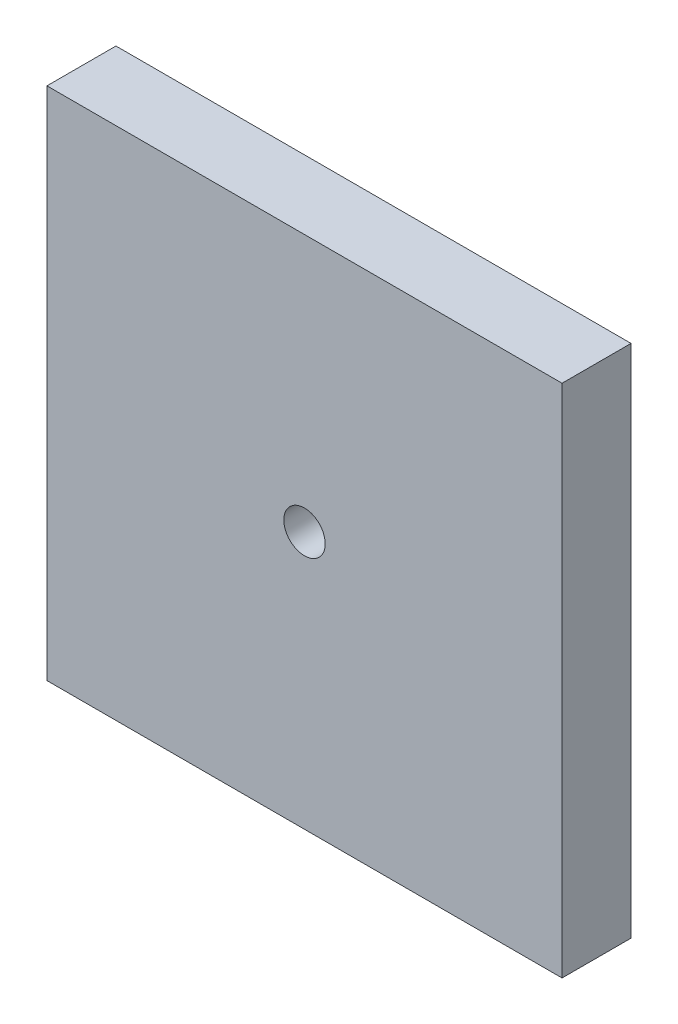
from build123d import *

# Parameters (mm, degrees)
SKETCH1_W                       = 88.9
SKETCH1_H                       = 88.9
BOSS_EXTRUDE1_DEPTH             = 11.90625
F_9_32_0_28125_DIAMETER_HOLE1_D = 7.14375


with BuildPart() as part:
    # Sketch1 → Boss-Extrude1 (new body)
    with BuildSketch(Plane.XY):
        Rectangle(SKETCH1_W, SKETCH1_H)
    extrude(amount=BOSS_EXTRUDE1_DEPTH)

    # 9_32 _0.28125_ Diameter Hole1 (through all)
    with Locations(Plane.XY.offset(11.90625)):
        with Locations((0, 0)):
            Hole(F_9_32_0_28125_DIAMETER_HOLE1_D / 2)


solid = part.part
